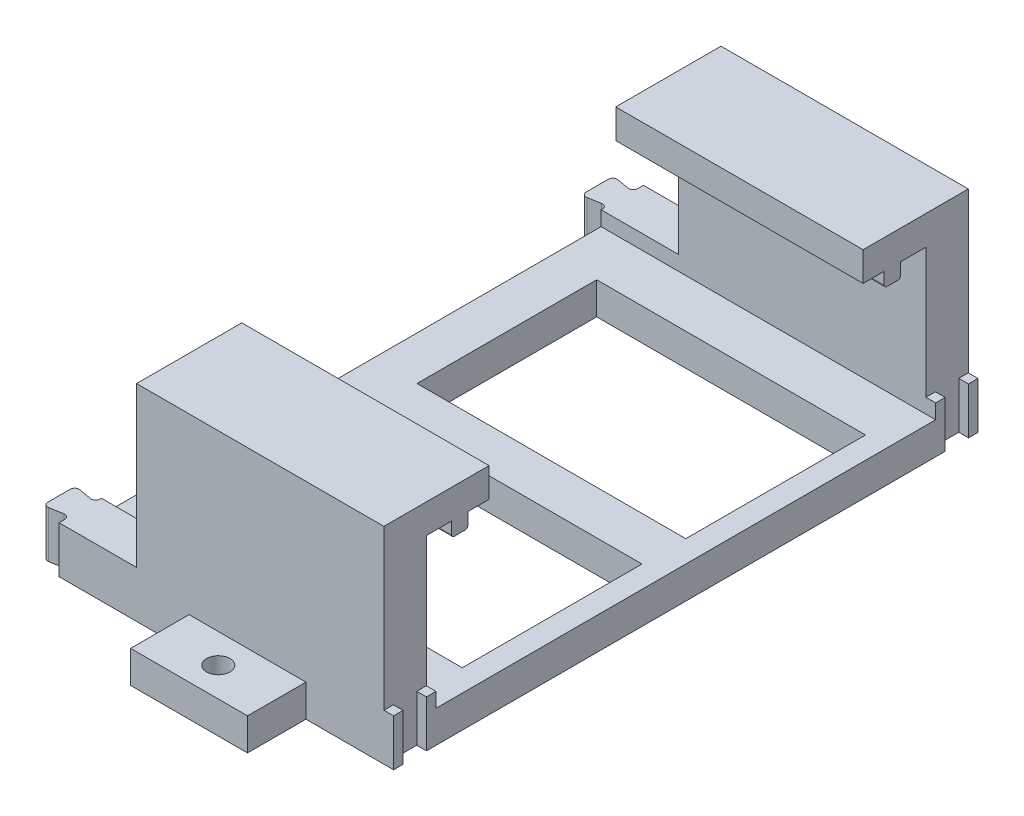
from build123d import *

# Parameters (mm, degrees)
SKETCH1_W                = 369
SKETCH1_H                = 200
BOSS_EXTRUDE1_DEPTH      = 16
SKETCH2_W                = 129
SKETCH2_H                = 16
BOSS_EXTRUDE2_DEPTH      = 12
SKETCH3_W                = 342
SKETCH3_H                = 168
CUT_EXTRUDE1_DEPTH       = 5
SKETCH4_W                = 100
SKETCH4_H                = 12
BOSS_EXTRUDE3_DEPTH      = 60
BOSS_EXTRUDE5_DEPTH      = 42
EXTRUDE_THIN1_DEPTH      = 7
SKETCH11_W               = 140
SKETCH11_H               = 200
CUT_EXTRUDE5_DEPTH       = 255.047731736
BOSS_EXTRUDE6_DEPTH      = 28
FILLET1_R                = 1.5
CUT_EXTRUDE6_DEPTH       = 246.813445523
CUT_EXTRUDE6_DEPTH_BACK  = 246.813445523
SKETCH14_W               = 151.600397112
SKETCH14_H               = 12
SKETCH15_W               = 97.865977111
SKETCH15_H               = 16
BOSS_EXTRUDE7_DEPTH      = 62
SKETCH16_W               = 97.865977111
SKETCH16_H               = 17.5
BOSS_EXTRUDE8_DEPTH      = 20
SKETCH17_W               = 97.865977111
SKETCH17_H               = 5.65
BOSS_EXTRUDE9_DEPTH      = 5
FILLET3_R                = 1
SKETCH18_W               = 12
SKETCH18_H               = 168
CUT_EXTRUDE7_DEPTH       = 5
SKETCH19_W               = 40
SKETCH19_H               = 11
BOSS_EXTRUDE10_DEPTH     = 20
SKETCH20_R               = 4
CUT_EXTRUDE8_DEPTH       = 231.063578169
FILLET3_OF_MIRROR3_R     = 1
SKETCH21_W               = 92
SKETCH21_H               = 61.5
CUT_EXTRUDE9_DEPTH       = 231.063578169
SKETCH22_W               = 1.5
SKETCH22_H               = 49.5
CUT_EXTRUDE10_DEPTH      = 195.970552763
CUT_EXTRUDE11_REACH      = 235.504
SKETCH23_W               = 13.223192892
SKETCH23_H               = 36
CUT_EXTRUDE12_REACH      = 235.504
SKETCH25_W               = 114.5
SKETCH25_H               = 240
CUT_EXTRUDE13_DEPTH      = 212.754574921
CUT_EXTRUDE13_DEPTH_BACK = 212.754574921
SKETCH26_W               = 84.642784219
SKETCH26_H               = 7.5
SKETCH28_W               = 3.324112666
SKETCH28_H               = 8
CUT_EXTRUDE14_DEPTH      = 150.232201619


with BuildPart() as part:
    # Sketch1 → Boss-Extrude1 (new body)
    with BuildSketch(Plane(origin=(0, 0, 0), x_dir=(1, 0, 0), z_dir=(0, 1, 0))):
        Rectangle(SKETCH1_W, SKETCH1_H)
    extrude(amount=BOSS_EXTRUDE1_DEPTH)

    # Sketch2 → Boss-Extrude2 (add)
    with BuildSketch(Plane(origin=(0, 16, 0), x_dir=(1, 0, 0), z_dir=(0, 1, 0))):
        Polygon((-184.5, -100), (-155.616556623, -100), (-119.5, -100), (-119.5, -84), (-169.5, -84), (-169.5, -36.5), (-184.5, -36.5), align=None)
        Polygon((-184.5, 100), (-155.616556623, 100), (-119.5, 100), (-119.5, 84), (-169.5, 84), (-169.5, 36.5), (-184.5, 36.5), align=None)
        with Locations((20, -92)):
            Rectangle(SKETCH2_W, SKETCH2_H)
        with Locations((20, 92)):
            Rectangle(SKETCH2_W, SKETCH2_H)
    extrude(amount=BOSS_EXTRUDE2_DEPTH)

    # Sketch3 → Cut-Extrude1 (cut)
    with BuildSketch(Plane(origin=(0, 16, 0), x_dir=(1, 0, 0), z_dir=(0, 1, 0))):
        with Locations((1.5, 0)):
            Rectangle(SKETCH3_W, SKETCH3_H)
    extrude(amount=-CUT_EXTRUDE1_DEPTH, mode=Mode.SUBTRACT)

    # Sketch4 → Boss-Extrude3 (add)
    with BuildSketch(Plane(origin=(0, 0, -100), x_dir=(-1, 0, 0), z_dir=(0, 0, -1))):
        with Locations((-19.5, 22)):
            Rectangle(SKETCH4_W, SKETCH4_H)
    extrude(amount=BOSS_EXTRUDE3_DEPTH)

    # Sketch8 → Boss-Extrude5 (add)
    with BuildSketch(Plane(origin=(0, 28, 0), x_dir=(1, 0, 0), z_dir=(0, 1, 0))):
        Polygon((-184.5, 36.5), (-169.5, 36.5), (-169.5, 84), (-119.5, 84), (-119.5, 100), (-184.5, 100), align=None)
    extrude(amount=BOSS_EXTRUDE5_DEPTH)

    # Sketch9 → Extrude-Thin1 (add)
    with BuildSketch(Plane(origin=(0, 70, 0), x_dir=(1, 0, 0), z_dir=(0, 1, 0))):
        Polygon((-119.5, 84), (-119.5, 70), (-155.5, 70), (-155.5, 35), (-169.5, 35), (-169.5, 45), (-165.5, 45), (-165.5, 80), (-129.5, 80), (-129.5, 84), align=None)
    extrude(amount=-EXTRUDE_THIN1_DEPTH)

    # Sketch11 → Cut-Extrude5 (cut, through all)
    with BuildSketch(Plane(origin=(0, 70, 0), x_dir=(1, 0, 0), z_dir=(0, 1, 0))):
        with Locations((-114.5, 0)):
            Rectangle(SKETCH11_W, SKETCH11_H)
    extrude(amount=-CUT_EXTRUDE5_DEPTH, mode=Mode.SUBTRACT)

    # Sketch13 → Boss-Extrude6 (add, through all)
    with BuildSketch(Plane(origin=(0, 28, 0), x_dir=(1, 0, 0), z_dir=(0, 1, 0))):
        Polygon((-44.5, 96.22), (-44.5, 87.78), (-52.3, 86.40464955), (-52.3, 97.59535045), align=None)
        Polygon((-44.5, -87.78), (-44.5, -96.22), (-52.5, -97.630615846), (-52.5, -86.369384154), align=None)
    extrude(amount=-BOSS_EXTRUDE6_DEPTH)

    # Fillet1
    fillet1_edges = [part.edges().sort_by_distance(p)[0] for p in [
        (-52.3, 14, -97.59535045),
        (-44.5, 14, -96.22),
        (-44.5, 14, -87.78),
        (-52.3, 14, -86.40464955),
        (-52.5, 14, 86.369384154),
        (-44.5, 14, 87.78),
        (-44.5, 14, 96.22),
        (-52.5, 14, 97.630615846),
    ]]
    fillet(fillet1_edges, radius=FILLET1_R)

    # Sketch14 → Cut-Extrude6 (cut, two sides: drawn at the far end of the back side and taken through both)
    with BuildSketch(Plane.XY.offset(-CUT_EXTRUDE6_DEPTH_BACK)):
        with Locations((8.699801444, 22)):
            Rectangle(SKETCH14_W, SKETCH14_H)
    extrude(amount=CUT_EXTRUDE6_DEPTH + CUT_EXTRUDE6_DEPTH_BACK, mode=Mode.SUBTRACT)

    # Sketch15 → Boss-Extrude7 (add)
    with BuildSketch(Plane(origin=(0, 16, 0), x_dir=(1, 0, 0), z_dir=(0, 1, 0))):
        with Locations((30.966091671, 92)):
            Rectangle(SKETCH15_W, SKETCH15_H)
    boss_extrude7 = extrude(amount=BOSS_EXTRUDE7_DEPTH)

    # Sketch16 → Boss-Extrude8 (add)
    with BuildSketch(Plane.XY.offset(-84)):
        with Locations((30.966091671, 69.25)):
            Rectangle(SKETCH16_W, SKETCH16_H)
    boss_extrude8 = extrude(amount=BOSS_EXTRUDE8_DEPTH)

    # Sketch17 → Boss-Extrude9 (add)
    with BuildSketch(Plane.XZ.offset(-60.5)):
        with Locations((30.966091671, -74.025)):
            Rectangle(SKETCH17_W, SKETCH17_H)
    boss_extrude9 = extrude(amount=BOSS_EXTRUDE9_DEPTH)

    # Fillet3
    fillet3_edges = [part.edges().sort_by_distance(p)[0] for p in [
        (30.96609167, 55.5, -76.85),
        (30.96609167, 55.5, -71.2),
    ]]
    fillet(fillet3_edges, radius=FILLET3_R)

    # Sketch18 → Cut-Extrude7 (cut)
    with BuildSketch(Plane(origin=(0, 16, 0), x_dir=(1, 0, 0), z_dir=(0, 1, 0))):
        with Locations((178.5, 0)):
            Rectangle(SKETCH18_W, SKETCH18_H)
    extrude(amount=-CUT_EXTRUDE7_DEPTH, mode=Mode.SUBTRACT)

    # Sketch19 → Boss-Extrude10 (add)
    with BuildSketch(Plane(origin=(0, 0, -100), x_dir=(-1, 0, 0), z_dir=(0, 0, -1))):
        with Locations((-20, 5.5)):
            Rectangle(SKETCH19_W, SKETCH19_H)
        with Locations((-164.5, 5.5)):
            Rectangle(SKETCH19_W, SKETCH19_H)
    boss_extrude10 = extrude(amount=BOSS_EXTRUDE10_DEPTH)

    # Sketch20 → Cut-Extrude8 (cut, through all)
    with BuildSketch(Plane(origin=(0, 11, 0), x_dir=(1, 0, 0), z_dir=(0, 1, 0))):
        with Locations(Location((164.5, 110, 0), (0, 0, 270))):
            Circle(SKETCH20_R)
        with Locations(Location((20, 110, 0), (0, 0, 270))):
            Circle(SKETCH20_R)
    cut_extrude8 = extrude(amount=-CUT_EXTRUDE8_DEPTH, mode=Mode.SUBTRACT)

    # Mirror3: Boss-Extrude7, Boss-Extrude8, Boss-Extrude9, Boss-Extrude10, Cut-Extrude8 across plane
    add(boss_extrude7.mirror(Plane.XY))
    add(boss_extrude8.mirror(Plane.XY))
    add(boss_extrude9.mirror(Plane.XY))
    add(boss_extrude10.mirror(Plane.XY))
    add(cut_extrude8.mirror(Plane.XY), mode=Mode.SUBTRACT)

    # Fillet3 of Mirror3
    fillet3_of_mirror3_edges = [part.edges().sort_by_distance(p)[0] for p in [
        (30.96609167, 55.5, 76.85),
        (30.96609167, 55.5, 71.2),
    ]]
    fillet(fillet3_of_mirror3_edges, radius=FILLET3_OF_MIRROR3_R)

    # Sketch21 → Cut-Extrude9 (cut, through all)
    with BuildSketch(Plane(origin=(0, 11, 0), x_dir=(1, 0, 0), z_dir=(0, 1, 0))):
        with Locations((16.5, 38.25)):
            Rectangle(SKETCH21_W, SKETCH21_H)
        with Locations((123.5, 38.25)):
            Rectangle(SKETCH21_W, SKETCH21_H)
        with Locations((16.5, -38.25)):
            Rectangle(SKETCH21_W, SKETCH21_H)
        with Locations((123.5, -38.25)):
            Rectangle(SKETCH21_W, SKETCH21_H)
    extrude(amount=-CUT_EXTRUDE9_DEPTH, mode=Mode.SUBTRACT)

    # Sketch22 → Cut-Extrude10 (cut, symmetric)
    with BuildSketch(Plane(origin=(79.899080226, 0, 0), x_dir=(0, 0, -1), z_dir=(1, 0, 0))):
        with Locations((-84.75, 35.75)):
            Rectangle(SKETCH22_W, SKETCH22_H)
    cut_extrude10 = extrude(amount=CUT_EXTRUDE10_DEPTH, both=True, mode=Mode.SUBTRACT)

    # Mirror4: Cut-Extrude10 across plane
    add(cut_extrude10.mirror(Plane.XY), mode=Mode.SUBTRACT)

    # Cut-Extrude11: up to this face of the body (flat: up to its plane)
    cut_extrude11_end = Plane(part.part.faces().sort_by_distance((-34.179093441, 16, 92.622493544))[0])
    # Sketch23 → Cut-Extrude11 (cut, up to the picked face)
    with BuildSketch(Plane(origin=(0, 78, 0), x_dir=(1, 0, 0), z_dir=(0, 1, 0)), mode=Mode.PRIVATE) as cut_extrude11_sk1:
        with Locations((73.28748378, -82)):
            Rectangle(SKETCH23_W, SKETCH23_H)
    cut_extrude11_tool1 = split(extrude(cut_extrude11_sk1.sketch, amount=-CUT_EXTRUDE11_REACH, mode=Mode.PRIVATE), bisect_by=cut_extrude11_end, keep=Keep.BOTH, mode=Mode.PRIVATE)
    cut_extrude11 = cut_extrude11_tool1.solids().sort_by(Axis((73.287484, 78, 82), (0, -1, 0)))[0]
    add(cut_extrude11, mode=Mode.SUBTRACT)

    # Mirror5: Cut-Extrude11 across plane
    add(cut_extrude11.mirror(Plane.XY), mode=Mode.SUBTRACT)

    # Cut-Extrude12: up to this face of the body (flat: up to its plane)
    cut_extrude12_end = Plane(part.part.faces().sort_by_distance((-34.179093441, 16, 92.622493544))[0])
    # Sketch25 → Cut-Extrude12 (cut, up to the picked face)
    with BuildSketch(Plane(origin=(0, 0, 0), x_dir=(1, 0, 0), z_dir=(0, 1, 0)), mode=Mode.PRIVATE) as cut_extrude12_sk1:
        with Locations((127.25, 0)):
            Rectangle(SKETCH25_W, SKETCH25_H)
    cut_extrude12_tool1 = split(extrude(cut_extrude12_sk1.sketch, amount=CUT_EXTRUDE12_REACH, mode=Mode.PRIVATE), bisect_by=cut_extrude12_end, keep=Keep.BOTH, mode=Mode.PRIVATE)
    add(cut_extrude12_tool1.solids().sort_by(Axis((127.25, 0, 0), (0, 1, 0)))[0], mode=Mode.SUBTRACT)

    # Sketch26 → Cut-Extrude13 (cut, two sides: drawn at the far end of the back side and taken through both)
    with BuildSketch(Plane.XY.offset(-64).offset(-CUT_EXTRUDE13_DEPTH_BACK)):
        with Locations((24.354495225, 74.25)):
            Rectangle(SKETCH26_W, SKETCH26_H)
    extrude(amount=CUT_EXTRUDE13_DEPTH + CUT_EXTRUDE13_DEPTH_BACK, mode=Mode.SUBTRACT)

    # Sketch28 → Cut-Extrude14 (cut, through all)
    with BuildSketch(Plane(origin=(0, 16, 0), x_dir=(1, 0, 0), z_dir=(0, 1, 0))):
        with Locations((68.337943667, -92.75)):
            Rectangle(SKETCH28_W, SKETCH28_H)
    cut_extrude14 = extrude(amount=-CUT_EXTRUDE14_DEPTH, mode=Mode.SUBTRACT)

    # Mirror6: Cut-Extrude14 across plane
    add(cut_extrude14.mirror(Plane.XY), mode=Mode.SUBTRACT)


solid = part.part
